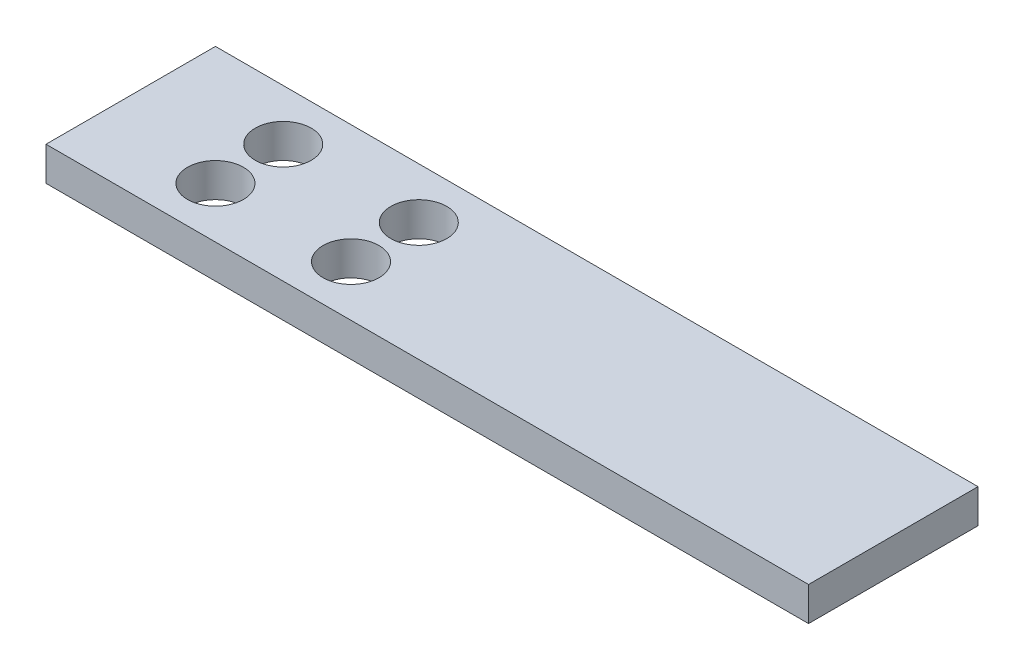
ISO-10303-21;
HEADER;
FILE_DESCRIPTION(('STEP AP214'),'2;1');
FILE_NAME('part.step','',(''),(''),'','','');
FILE_SCHEMA(('AUTOMOTIVE_DESIGN { 1 0 10303 214 1 1 1 1 }'));
ENDSEC;
DATA;
#1=APPLICATION_CONTEXT('core data for automotive mechanical design processes');
#2=APPLICATION_PROTOCOL_DEFINITION('international standard','automotive_design',2000,#1);
#3=PRODUCT_CONTEXT('',#1,'mechanical');
#4=PRODUCT('Part','Part','',(#3));
#5=PRODUCT_RELATED_PRODUCT_CATEGORY('part','',(#4));
#6=PRODUCT_DEFINITION_FORMATION('','',#4);
#7=PRODUCT_DEFINITION_CONTEXT('part definition',#1,'design');
#8=PRODUCT_DEFINITION('design','',#6,#7);
#9=PRODUCT_DEFINITION_SHAPE('','',#8);
#10=(LENGTH_UNIT() NAMED_UNIT(*) SI_UNIT(.MILLI.,.METRE.));
#11=(NAMED_UNIT(*) PLANE_ANGLE_UNIT() SI_UNIT($,.RADIAN.));
#12=(NAMED_UNIT(*) SI_UNIT($,.STERADIAN.) SOLID_ANGLE_UNIT());
#13=UNCERTAINTY_MEASURE_WITH_UNIT(LENGTH_MEASURE(1.E-05),#10,'distance_accuracy_value','');
#14=(GEOMETRIC_REPRESENTATION_CONTEXT(3) GLOBAL_UNCERTAINTY_ASSIGNED_CONTEXT((#13)) GLOBAL_UNIT_ASSIGNED_CONTEXT((#10,
#11,#12)) REPRESENTATION_CONTEXT('',''));
#15=CARTESIAN_POINT('',(0.,0.,0.));
#16=DIRECTION('',(0.,0.,1.));
#17=DIRECTION('',(1.,0.,0.));
#18=AXIS2_PLACEMENT_3D('',#15,#16,#17);
#19=CARTESIAN_POINT('',(0.,2.,0.));
#20=DIRECTION('',(1.,0.,0.));
#21=DIRECTION('',(0.,0.,-1.));
#22=AXIS2_PLACEMENT_3D('',#19,#20,#21);
#23=PLANE('',#22);
#24=DIRECTION('',(0.,0.,1.));
#25=VECTOR('',#24,1.);
#26=CARTESIAN_POINT('',(0.,0.,0.));
#27=LINE('',#26,#25);
#28=CARTESIAN_POINT('',(0.,0.,-10.));
#29=VERTEX_POINT('',#28);
#30=CARTESIAN_POINT('',(0.,0.,0.));
#31=VERTEX_POINT('',#30);
#32=EDGE_CURVE('E96',#29,#31,#27,.T.);
#33=ORIENTED_EDGE('',*,*,#32,.T.);
#34=DIRECTION('',(0.,-1.,0.));
#35=VECTOR('',#34,1.);
#36=CARTESIAN_POINT('',(0.,2.,0.));
#37=LINE('',#36,#35);
#38=CARTESIAN_POINT('',(0.,2.,0.));
#39=VERTEX_POINT('',#38);
#40=EDGE_CURVE('E11',#39,#31,#37,.T.);
#41=ORIENTED_EDGE('',*,*,#40,.F.);
#42=DIRECTION('',(0.,0.,1.));
#43=VECTOR('',#42,1.);
#44=CARTESIAN_POINT('',(0.,2.,0.));
#45=LINE('',#44,#43);
#46=CARTESIAN_POINT('',(0.,2.,-10.));
#47=VERTEX_POINT('',#46);
#48=EDGE_CURVE('E84',#47,#39,#45,.T.);
#49=ORIENTED_EDGE('',*,*,#48,.F.);
#50=DIRECTION('',(0.,-1.,0.));
#51=VECTOR('',#50,1.);
#52=CARTESIAN_POINT('',(0.,2.,-10.));
#53=LINE('',#52,#51);
#54=EDGE_CURVE('E92',#47,#29,#53,.T.);
#55=ORIENTED_EDGE('',*,*,#54,.T.);
#56=EDGE_LOOP('',(#33,#41,#49,#55));
#57=FACE_BOUND('',#56,.T.);
#58=ADVANCED_FACE('F33',(#57),#23,.F.);
#59=CARTESIAN_POINT('',(0.,2.,0.));
#60=DIRECTION('',(0.,0.,-1.));
#61=DIRECTION('',(-1.,0.,0.));
#62=AXIS2_PLACEMENT_3D('',#59,#60,#61);
#63=PLANE('',#62);
#64=DIRECTION('',(1.,0.,0.));
#65=VECTOR('',#64,1.);
#66=CARTESIAN_POINT('',(0.,0.,0.));
#67=LINE('',#66,#65);
#68=CARTESIAN_POINT('',(45.,0.,0.));
#69=VERTEX_POINT('',#68);
#70=EDGE_CURVE('E88',#31,#69,#67,.T.);
#71=ORIENTED_EDGE('',*,*,#70,.T.);
#72=DIRECTION('',(0.,-1.,0.));
#73=VECTOR('',#72,1.);
#74=CARTESIAN_POINT('',(45.,2.,0.));
#75=LINE('',#74,#73);
#76=CARTESIAN_POINT('',(45.,2.,0.));
#77=VERTEX_POINT('',#76);
#78=EDGE_CURVE('E41',#77,#69,#75,.T.);
#79=ORIENTED_EDGE('',*,*,#78,.F.);
#80=DIRECTION('',(1.,0.,0.));
#81=VECTOR('',#80,1.);
#82=CARTESIAN_POINT('',(0.,2.,0.));
#83=LINE('',#82,#81);
#84=EDGE_CURVE('E79',#39,#77,#83,.T.);
#85=ORIENTED_EDGE('',*,*,#84,.F.);
#86=ORIENTED_EDGE('',*,*,#40,.T.);
#87=EDGE_LOOP('',(#71,#79,#85,#86));
#88=FACE_BOUND('',#87,.T.);
#89=ADVANCED_FACE('F87',(#88),#63,.F.);
#90=CARTESIAN_POINT('',(45.,2.,0.));
#91=DIRECTION('',(-1.,0.,0.));
#92=DIRECTION('',(0.,0.,1.));
#93=AXIS2_PLACEMENT_3D('',#90,#91,#92);
#94=PLANE('',#93);
#95=DIRECTION('',(0.,0.,-1.));
#96=VECTOR('',#95,1.);
#97=CARTESIAN_POINT('',(45.,0.,0.));
#98=LINE('',#97,#96);
#99=CARTESIAN_POINT('',(45.,0.,-10.));
#100=VERTEX_POINT('',#99);
#101=EDGE_CURVE('E66',#69,#100,#98,.T.);
#102=ORIENTED_EDGE('',*,*,#101,.T.);
#103=DIRECTION('',(0.,-1.,0.));
#104=VECTOR('',#103,1.);
#105=CARTESIAN_POINT('',(45.,2.,-10.));
#106=LINE('',#105,#104);
#107=CARTESIAN_POINT('',(45.,2.,-10.));
#108=VERTEX_POINT('',#107);
#109=EDGE_CURVE('E89',#108,#100,#106,.T.);
#110=ORIENTED_EDGE('',*,*,#109,.F.);
#111=DIRECTION('',(0.,0.,-1.));
#112=VECTOR('',#111,1.);
#113=CARTESIAN_POINT('',(45.,2.,0.));
#114=LINE('',#113,#112);
#115=EDGE_CURVE('E82',#77,#108,#114,.T.);
#116=ORIENTED_EDGE('',*,*,#115,.F.);
#117=ORIENTED_EDGE('',*,*,#78,.T.);
#118=EDGE_LOOP('',(#102,#110,#116,#117));
#119=FACE_BOUND('',#118,.T.);
#120=ADVANCED_FACE('F90',(#119),#94,.F.);
#121=CARTESIAN_POINT('',(0.,2.,-10.));
#122=DIRECTION('',(0.,0.,1.));
#123=DIRECTION('',(1.,0.,0.));
#124=AXIS2_PLACEMENT_3D('',#121,#122,#123);
#125=PLANE('',#124);
#126=DIRECTION('',(-1.,0.,0.));
#127=VECTOR('',#126,1.);
#128=CARTESIAN_POINT('',(0.,0.,-10.));
#129=LINE('',#128,#127);
#130=EDGE_CURVE('E72',#100,#29,#129,.T.);
#131=ORIENTED_EDGE('',*,*,#130,.T.);
#132=ORIENTED_EDGE('',*,*,#54,.F.);
#133=DIRECTION('',(-1.,0.,0.));
#134=VECTOR('',#133,1.);
#135=CARTESIAN_POINT('',(0.,2.,-10.));
#136=LINE('',#135,#134);
#137=EDGE_CURVE('E49',#108,#47,#136,.T.);
#138=ORIENTED_EDGE('',*,*,#137,.F.);
#139=ORIENTED_EDGE('',*,*,#109,.T.);
#140=EDGE_LOOP('',(#131,#132,#138,#139));
#141=FACE_BOUND('',#140,.T.);
#142=ADVANCED_FACE('F104',(#141),#125,.F.);
#143=CARTESIAN_POINT('',(0.,2.,0.));
#144=DIRECTION('',(0.,-1.,0.));
#145=DIRECTION('',(0.,0.,-1.));
#146=AXIS2_PLACEMENT_3D('',#143,#144,#145);
#147=PLANE('',#146);
#148=CARTESIAN_POINT('',(6.99999999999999,2.,-2.99999999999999));
#149=DIRECTION('',(0.,1.,0.));
#150=DIRECTION('',(0.,0.,1.));
#151=AXIS2_PLACEMENT_3D('',#148,#149,#150);
#152=CIRCLE('',#151,1.64999999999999);
#153=CARTESIAN_POINT('',(6.99999999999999,2.,-1.35));
#154=VERTEX_POINT('',#153);
#155=EDGE_CURVE('E130',#154,#154,#152,.T.);
#156=ORIENTED_EDGE('',*,*,#155,.F.);
#157=EDGE_LOOP('',(#156));
#158=FACE_BOUND('',#157,.T.);
#159=CARTESIAN_POINT('',(6.99999999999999,2.,-6.99999999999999));
#160=DIRECTION('',(0.,1.,0.));
#161=DIRECTION('',(0.,0.,1.));
#162=AXIS2_PLACEMENT_3D('',#159,#160,#161);
#163=CIRCLE('',#162,1.64999999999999);
#164=CARTESIAN_POINT('',(6.99999999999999,2.,-5.35));
#165=VERTEX_POINT('',#164);
#166=EDGE_CURVE('E124',#165,#165,#163,.T.);
#167=ORIENTED_EDGE('',*,*,#166,.F.);
#168=EDGE_LOOP('',(#167));
#169=FACE_BOUND('',#168,.T.);
#170=CARTESIAN_POINT('',(15.,2.,-2.99999999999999));
#171=DIRECTION('',(0.,1.,0.));
#172=DIRECTION('',(0.,0.,1.));
#173=AXIS2_PLACEMENT_3D('',#170,#171,#172);
#174=CIRCLE('',#173,1.64999999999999);
#175=CARTESIAN_POINT('',(15.,2.,-1.35));
#176=VERTEX_POINT('',#175);
#177=EDGE_CURVE('E118',#176,#176,#174,.T.);
#178=ORIENTED_EDGE('',*,*,#177,.F.);
#179=EDGE_LOOP('',(#178));
#180=FACE_BOUND('',#179,.T.);
#181=CARTESIAN_POINT('',(15.,2.,-6.99999999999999));
#182=DIRECTION('',(0.,1.,0.));
#183=DIRECTION('',(0.,0.,1.));
#184=AXIS2_PLACEMENT_3D('',#181,#182,#183);
#185=CIRCLE('',#184,1.64999999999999);
#186=CARTESIAN_POINT('',(15.,2.,-5.35));
#187=VERTEX_POINT('',#186);
#188=EDGE_CURVE('E112',#187,#187,#185,.T.);
#189=ORIENTED_EDGE('',*,*,#188,.F.);
#190=EDGE_LOOP('',(#189));
#191=FACE_BOUND('',#190,.T.);
#192=ORIENTED_EDGE('',*,*,#48,.T.);
#193=ORIENTED_EDGE('',*,*,#84,.T.);
#194=ORIENTED_EDGE('',*,*,#115,.T.);
#195=ORIENTED_EDGE('',*,*,#137,.T.);
#196=EDGE_LOOP('',(#192,#193,#194,#195));
#197=FACE_BOUND('',#196,.T.);
#198=ADVANCED_FACE('F80',(#158,#169,#180,#191,#197),#147,.F.);
#199=CARTESIAN_POINT('',(0.,0.,0.));
#200=DIRECTION('',(0.,-1.,0.));
#201=DIRECTION('',(0.,0.,-1.));
#202=AXIS2_PLACEMENT_3D('',#199,#200,#201);
#203=PLANE('',#202);
#204=CARTESIAN_POINT('',(6.99999999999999,0.,-2.99999999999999));
#205=DIRECTION('',(0.,1.,0.));
#206=DIRECTION('',(0.,0.,1.));
#207=AXIS2_PLACEMENT_3D('',#204,#205,#206);
#208=CIRCLE('',#207,1.64999999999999);
#209=CARTESIAN_POINT('',(6.99999999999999,0.,-1.35));
#210=VERTEX_POINT('',#209);
#211=EDGE_CURVE('E127',#210,#210,#208,.T.);
#212=ORIENTED_EDGE('',*,*,#211,.T.);
#213=EDGE_LOOP('',(#212));
#214=FACE_BOUND('',#213,.T.);
#215=CARTESIAN_POINT('',(6.99999999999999,0.,-6.99999999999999));
#216=DIRECTION('',(0.,1.,0.));
#217=DIRECTION('',(0.,0.,1.));
#218=AXIS2_PLACEMENT_3D('',#215,#216,#217);
#219=CIRCLE('',#218,1.64999999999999);
#220=CARTESIAN_POINT('',(6.99999999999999,0.,-5.35));
#221=VERTEX_POINT('',#220);
#222=EDGE_CURVE('E121',#221,#221,#219,.T.);
#223=ORIENTED_EDGE('',*,*,#222,.T.);
#224=EDGE_LOOP('',(#223));
#225=FACE_BOUND('',#224,.T.);
#226=CARTESIAN_POINT('',(15.,0.,-2.99999999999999));
#227=DIRECTION('',(0.,1.,0.));
#228=DIRECTION('',(0.,0.,1.));
#229=AXIS2_PLACEMENT_3D('',#226,#227,#228);
#230=CIRCLE('',#229,1.64999999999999);
#231=CARTESIAN_POINT('',(15.,0.,-1.35));
#232=VERTEX_POINT('',#231);
#233=EDGE_CURVE('E115',#232,#232,#230,.T.);
#234=ORIENTED_EDGE('',*,*,#233,.T.);
#235=EDGE_LOOP('',(#234));
#236=FACE_BOUND('',#235,.T.);
#237=CARTESIAN_POINT('',(15.,0.,-6.99999999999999));
#238=DIRECTION('',(0.,1.,0.));
#239=DIRECTION('',(0.,0.,1.));
#240=AXIS2_PLACEMENT_3D('',#237,#238,#239);
#241=CIRCLE('',#240,1.64999999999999);
#242=CARTESIAN_POINT('',(15.,0.,-5.35));
#243=VERTEX_POINT('',#242);
#244=EDGE_CURVE('E99',#243,#243,#241,.T.);
#245=ORIENTED_EDGE('',*,*,#244,.T.);
#246=EDGE_LOOP('',(#245));
#247=FACE_BOUND('',#246,.T.);
#248=ORIENTED_EDGE('',*,*,#32,.F.);
#249=ORIENTED_EDGE('',*,*,#130,.F.);
#250=ORIENTED_EDGE('',*,*,#101,.F.);
#251=ORIENTED_EDGE('',*,*,#70,.F.);
#252=EDGE_LOOP('',(#248,#249,#250,#251));
#253=FACE_BOUND('',#252,.T.);
#254=ADVANCED_FACE('F107',(#214,#225,#236,#247,#253),#203,.T.);
#255=CARTESIAN_POINT('',(15.,2.,-6.99999999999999));
#256=DIRECTION('',(0.,1.,0.));
#257=DIRECTION('',(0.,0.,1.));
#258=AXIS2_PLACEMENT_3D('',#255,#256,#257);
#259=CYLINDRICAL_SURFACE('',#258,1.64999999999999);
#260=ORIENTED_EDGE('',*,*,#244,.F.);
#261=EDGE_LOOP('',(#260));
#262=FACE_BOUND('',#261,.T.);
#263=ORIENTED_EDGE('',*,*,#188,.T.);
#264=EDGE_LOOP('',(#263));
#265=FACE_BOUND('',#264,.T.);
#266=ADVANCED_FACE('F145',(#262,#265),#259,.F.);
#267=CARTESIAN_POINT('',(15.,2.,-2.99999999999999));
#268=DIRECTION('',(0.,1.,0.));
#269=DIRECTION('',(0.,0.,1.));
#270=AXIS2_PLACEMENT_3D('',#267,#268,#269);
#271=CYLINDRICAL_SURFACE('',#270,1.64999999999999);
#272=ORIENTED_EDGE('',*,*,#233,.F.);
#273=EDGE_LOOP('',(#272));
#274=FACE_BOUND('',#273,.T.);
#275=ORIENTED_EDGE('',*,*,#177,.T.);
#276=EDGE_LOOP('',(#275));
#277=FACE_BOUND('',#276,.T.);
#278=ADVANCED_FACE('F147',(#274,#277),#271,.F.);
#279=CARTESIAN_POINT('',(6.99999999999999,2.,-6.99999999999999));
#280=DIRECTION('',(0.,1.,0.));
#281=DIRECTION('',(0.,0.,1.));
#282=AXIS2_PLACEMENT_3D('',#279,#280,#281);
#283=CYLINDRICAL_SURFACE('',#282,1.64999999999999);
#284=ORIENTED_EDGE('',*,*,#222,.F.);
#285=EDGE_LOOP('',(#284));
#286=FACE_BOUND('',#285,.T.);
#287=ORIENTED_EDGE('',*,*,#166,.T.);
#288=EDGE_LOOP('',(#287));
#289=FACE_BOUND('',#288,.T.);
#290=ADVANCED_FACE('F154',(#286,#289),#283,.F.);
#291=CARTESIAN_POINT('',(6.99999999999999,2.,-2.99999999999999));
#292=DIRECTION('',(0.,1.,0.));
#293=DIRECTION('',(0.,0.,1.));
#294=AXIS2_PLACEMENT_3D('',#291,#292,#293);
#295=CYLINDRICAL_SURFACE('',#294,1.64999999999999);
#296=ORIENTED_EDGE('',*,*,#211,.F.);
#297=EDGE_LOOP('',(#296));
#298=FACE_BOUND('',#297,.T.);
#299=ORIENTED_EDGE('',*,*,#155,.T.);
#300=EDGE_LOOP('',(#299));
#301=FACE_BOUND('',#300,.T.);
#302=ADVANCED_FACE('F134',(#298,#301),#295,.F.);
#303=CLOSED_SHELL('',(#58,#89,#120,#142,#198,#254,#266,#278,#290,#302));
#304=MANIFOLD_SOLID_BREP('B2',#303);
#305=ADVANCED_BREP_SHAPE_REPRESENTATION('',(#18,#304),#14);
#306=SHAPE_DEFINITION_REPRESENTATION(#9,#305);
ENDSEC;
END-ISO-10303-21;
